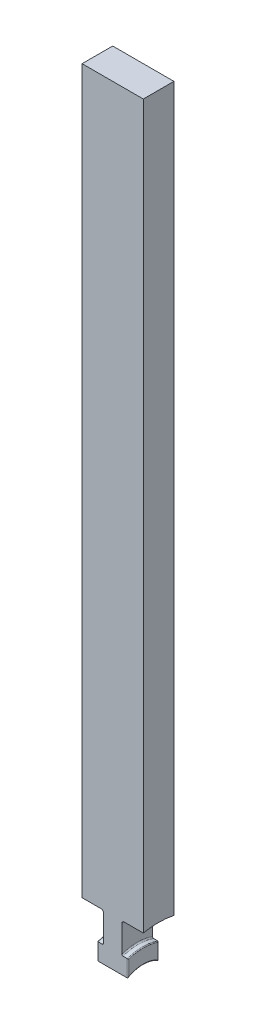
from build123d import *

# Parameters (mm, degrees)
SKETCH1_W               = 10
SKETCH1_H               = 260
BOSS_EXTRUDE1_DEPTH     = 10
CUT_EXTRUDE4_DEPTH      = 261.240273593
CUT_EXTRUDE4_DEPTH_BACK = 261.240273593
SKETCH8_R               = 10
SKETCH2_W               = 7
SKETCH2_H               = 9.5
CUT_EXTRUDE3_DEPTH      = 261.240273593
CUT_EXTRUDE3_DEPTH_BACK = 261.240273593
SKETCH7_W               = 5
SKETCH7_H               = 15
FILLET1_R               = 0.762
FILLET2_R               = 0.381
FILLET3_R               = 0.25


with BuildPart() as part:
    # Sketch1 → Boss-Extrude1 (new, symmetric)
    with BuildSketch(Plane(origin=(0, 0, 0), x_dir=(0, 0, -1), z_dir=(1, 0, 0))):
        with Locations((0, 130)):
            Rectangle(SKETCH1_W, SKETCH1_H)
    extrude(amount=BOSS_EXTRUDE1_DEPTH, both=True)

    # Sketch8 → Cut-Extrude4 (cut, two sides: drawn at the far end of the back side and taken through both)
    with BuildSketch(Plane(origin=(0, 0, 0), x_dir=(0, 0, -1), z_dir=(1, 0, 0)).offset(-CUT_EXTRUDE4_DEPTH_BACK)):
        Circle(SKETCH8_R)
    extrude(amount=CUT_EXTRUDE4_DEPTH + CUT_EXTRUDE4_DEPTH_BACK, mode=Mode.SUBTRACT)

    # Sketch2 → Cut-Revolve1 (revolve, cut)
    with BuildSketch(Plane.XY):
        with Locations((6.5, 19.75)):
            Rectangle(SKETCH2_W, SKETCH2_H)
        with Locations((-6.5, 19.75)):
            Rectangle(SKETCH2_W, SKETCH2_H)
    revolve(axis=Axis((-8.84822894, 0, 0), (1, 0, 0)), mode=Mode.SUBTRACT)

    # Sketch7 → Cut-Extrude3 (cut, two sides: drawn at the far end of the back side and taken through both)
    with BuildSketch(Plane.XY.offset(-CUT_EXTRUDE3_DEPTH_BACK)):
        with Locations((-7.5, 7.5)):
            Rectangle(SKETCH7_W, SKETCH7_H)
        with Locations((7.5, 7.5)):
            Rectangle(SKETCH7_W, SKETCH7_H)
    extrude(amount=CUT_EXTRUDE3_DEPTH + CUT_EXTRUDE3_DEPTH_BACK, mode=Mode.SUBTRACT)

    # Fillet1
    fillet1_edges = [part.edges().sort_by_distance(p)[0] for p in [
        (3, 24.5, 0),
        (-3, 24.5, 0),
    ]]
    fillet(fillet1_edges, radius=FILLET1_R)

    # Fillet2
    fillet2_edges = [part.edges().sort_by_distance(p)[0] for p in [
        (3, 15, 0),
        (-3, 15, 0),
    ]]
    fillet(fillet2_edges, radius=FILLET2_R)

    # Fillet3
    fillet3_edges = [part.edges().sort_by_distance(p)[0] for p in [
        (5, 15, 0),
        (-5, 15, 0),
        (-5, 10, 0),
        (-5, 11.401194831, -5),
        (-5, 11.401194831, 5),
        (5, 11.401194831, -5),
        (5, 10, 0),
        (5, 11.401194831, 5),
    ]]
    fillet(fillet3_edges, radius=FILLET3_R)


solid = part.part
